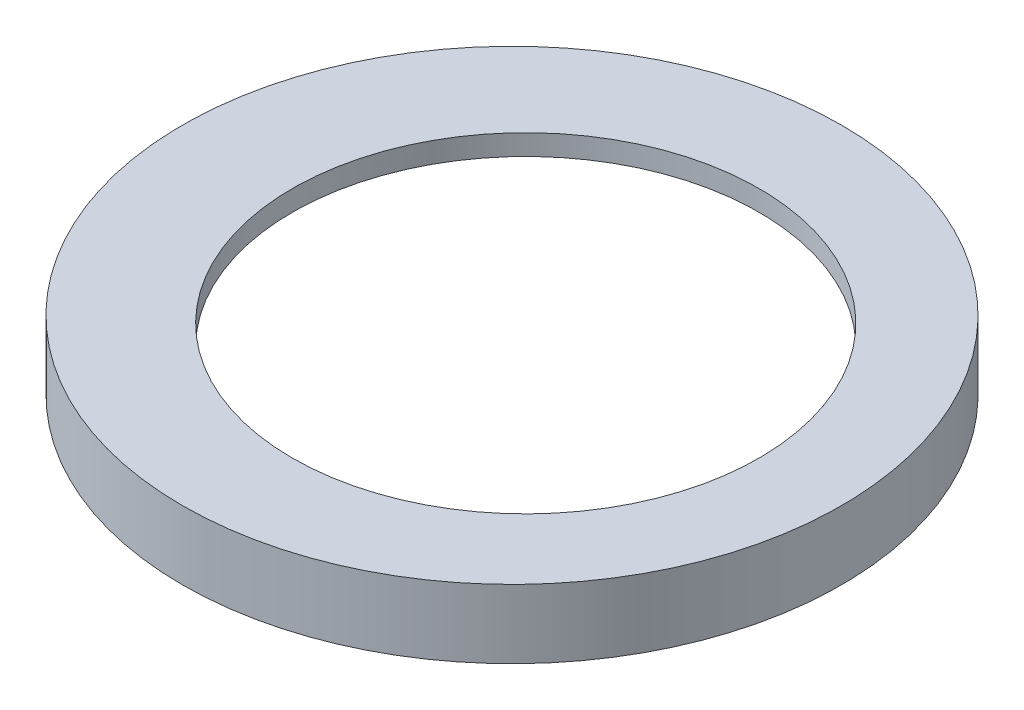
from build123d import *

# Parameters (mm, degrees)
SKETCH_1_R      = 23.2
SKETCH_1_R_2    = 17
EXTRUDE_1_DEPTH = 1.5
EXTRUDE_START   = -5
SKETCH_2_R      = 24
SKETCH_2_R_2    = 23.2
EXTRUDE_2_DEPTH = 5
SKETCH_3_R      = 1.35
EXTRUDE_3_DEPTH = 0.45


with BuildPart() as part:
    # Sketch 1 → Extrude 1 (new body)
    with BuildSketch(Plane(origin=(0, 0, 0), x_dir=(1, 0, 0), z_dir=(0, 1, 0))):
        with Locations(Location((-1, 0, 0), (0, 0, 270))):
            Circle(SKETCH_1_R)
        with Locations(Location((0, 0, 0), (0, 0, 270))):
            Circle(SKETCH_1_R_2, mode=Mode.SUBTRACT)
    extrude(amount=EXTRUDE_1_DEPTH)

    # Sketch 2 → Extrude 2 (add)
    with BuildSketch(Plane(origin=(0, 1.5, 0), x_dir=(1, 0, 0), z_dir=(0, 1, 0)).offset(EXTRUDE_START)):
        with Locations(Location((-1, 0, 0), (0, 0, 270))):
            Circle(SKETCH_2_R)
        with Locations(Location((-1, 0, 0), (0, 0, 270))):
            Circle(SKETCH_2_R_2, mode=Mode.SUBTRACT)
    extrude(amount=EXTRUDE_2_DEPTH)

    # Sketch 3 → Extrude 3 (add)
    with BuildSketch(Plane(origin=(0, 0, 0), x_dir=(-1, 0, 0), z_dir=(0, -1, 0))):
        with Locations(Location((22, 0, 0), (0, 0, 270))):
            Circle(SKETCH_3_R)
    extrude(amount=EXTRUDE_3_DEPTH)


solid = part.part
